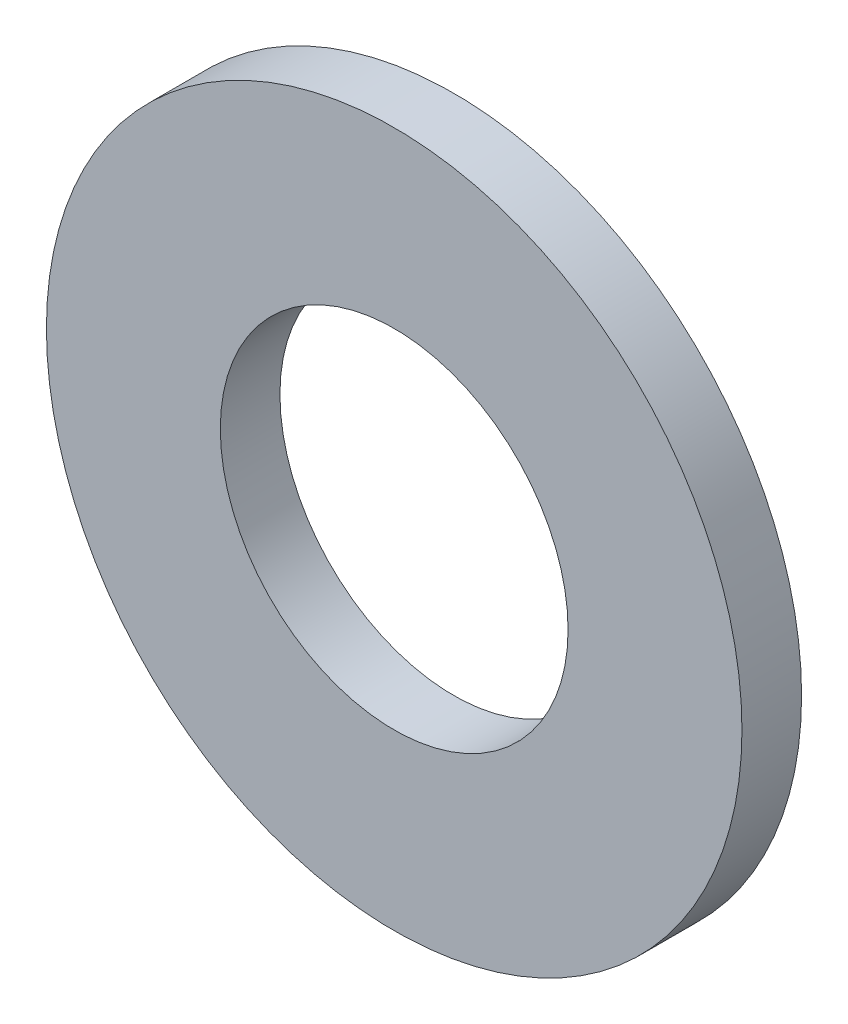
ISO-10303-21;
HEADER;
FILE_DESCRIPTION(('STEP AP214'),'2;1');
FILE_NAME('part.step','',(''),(''),'','','');
FILE_SCHEMA(('AUTOMOTIVE_DESIGN { 1 0 10303 214 1 1 1 1 }'));
ENDSEC;
DATA;
#1=APPLICATION_CONTEXT('core data for automotive mechanical design processes');
#2=APPLICATION_PROTOCOL_DEFINITION('international standard','automotive_design',2000,#1);
#3=PRODUCT_CONTEXT('',#1,'mechanical');
#4=PRODUCT('Part','Part','',(#3));
#5=PRODUCT_RELATED_PRODUCT_CATEGORY('part','',(#4));
#6=PRODUCT_DEFINITION_FORMATION('','',#4);
#7=PRODUCT_DEFINITION_CONTEXT('part definition',#1,'design');
#8=PRODUCT_DEFINITION('design','',#6,#7);
#9=PRODUCT_DEFINITION_SHAPE('','',#8);
#10=(LENGTH_UNIT() NAMED_UNIT(*) SI_UNIT(.MILLI.,.METRE.));
#11=(NAMED_UNIT(*) PLANE_ANGLE_UNIT() SI_UNIT($,.RADIAN.));
#12=(NAMED_UNIT(*) SI_UNIT($,.STERADIAN.) SOLID_ANGLE_UNIT());
#13=UNCERTAINTY_MEASURE_WITH_UNIT(LENGTH_MEASURE(1.E-05),#10,'distance_accuracy_value','');
#14=(GEOMETRIC_REPRESENTATION_CONTEXT(3) GLOBAL_UNCERTAINTY_ASSIGNED_CONTEXT((#13)) GLOBAL_UNIT_ASSIGNED_CONTEXT((#10,
#11,#12)) REPRESENTATION_CONTEXT('',''));
#15=CARTESIAN_POINT('',(0.,0.,0.));
#16=DIRECTION('',(0.,0.,1.));
#17=DIRECTION('',(1.,0.,0.));
#18=AXIS2_PLACEMENT_3D('',#15,#16,#17);
#19=CARTESIAN_POINT('',(0.,0.,0.6));
#20=DIRECTION('',(0.,0.,1.));
#21=DIRECTION('',(1.,0.,0.));
#22=AXIS2_PLACEMENT_3D('',#19,#20,#21);
#23=PLANE('',#22);
#24=CARTESIAN_POINT('',(0.,0.,0.6));
#25=DIRECTION('',(0.,0.,1.));
#26=DIRECTION('',(1.,0.,0.));
#27=AXIS2_PLACEMENT_3D('',#24,#25,#26);
#28=CIRCLE('',#27,7.);
#29=CARTESIAN_POINT('',(7.,0.,0.6));
#30=VERTEX_POINT('',#29);
#31=EDGE_CURVE('E10',#30,#30,#28,.T.);
#32=ORIENTED_EDGE('',*,*,#31,.T.);
#33=EDGE_LOOP('',(#32));
#34=FACE_BOUND('',#33,.T.);
#35=CARTESIAN_POINT('',(0.,0.,0.6));
#36=DIRECTION('',(0.,0.,1.));
#37=DIRECTION('',(1.,0.,0.));
#38=AXIS2_PLACEMENT_3D('',#35,#36,#37);
#39=CIRCLE('',#38,3.5);
#40=CARTESIAN_POINT('',(3.5,0.,0.6));
#41=VERTEX_POINT('',#40);
#42=EDGE_CURVE('E40',#41,#41,#39,.T.);
#43=ORIENTED_EDGE('',*,*,#42,.F.);
#44=EDGE_LOOP('',(#43));
#45=FACE_BOUND('',#44,.T.);
#46=ADVANCED_FACE('F29',(#34,#45),#23,.T.);
#47=CARTESIAN_POINT('',(0.,0.,-0.6));
#48=DIRECTION('',(0.,0.,1.));
#49=DIRECTION('',(1.,0.,0.));
#50=AXIS2_PLACEMENT_3D('',#47,#48,#49);
#51=PLANE('',#50);
#52=CARTESIAN_POINT('',(0.,0.,-0.6));
#53=DIRECTION('',(0.,0.,1.));
#54=DIRECTION('',(1.,0.,0.));
#55=AXIS2_PLACEMENT_3D('',#52,#53,#54);
#56=CIRCLE('',#55,7.);
#57=CARTESIAN_POINT('',(7.,0.,-0.6));
#58=VERTEX_POINT('',#57);
#59=EDGE_CURVE('E36',#58,#58,#56,.T.);
#60=ORIENTED_EDGE('',*,*,#59,.F.);
#61=EDGE_LOOP('',(#60));
#62=FACE_BOUND('',#61,.T.);
#63=CARTESIAN_POINT('',(0.,0.,-0.6));
#64=DIRECTION('',(0.,0.,1.));
#65=DIRECTION('',(1.,0.,0.));
#66=AXIS2_PLACEMENT_3D('',#63,#64,#65);
#67=CIRCLE('',#66,3.5);
#68=CARTESIAN_POINT('',(3.5,0.,-0.6));
#69=VERTEX_POINT('',#68);
#70=EDGE_CURVE('E44',#69,#69,#67,.T.);
#71=ORIENTED_EDGE('',*,*,#70,.T.);
#72=EDGE_LOOP('',(#71));
#73=FACE_BOUND('',#72,.T.);
#74=ADVANCED_FACE('F50',(#62,#73),#51,.F.);
#75=CARTESIAN_POINT('',(0.,0.,0.6));
#76=DIRECTION('',(0.,0.,-1.));
#77=DIRECTION('',(-1.,0.,0.));
#78=AXIS2_PLACEMENT_3D('',#75,#76,#77);
#79=CYLINDRICAL_SURFACE('',#78,7.);
#80=ORIENTED_EDGE('',*,*,#31,.F.);
#81=EDGE_LOOP('',(#80));
#82=FACE_BOUND('',#81,.T.);
#83=ORIENTED_EDGE('',*,*,#59,.T.);
#84=EDGE_LOOP('',(#83));
#85=FACE_BOUND('',#84,.T.);
#86=ADVANCED_FACE('F31',(#82,#85),#79,.T.);
#87=CARTESIAN_POINT('',(0.,0.,0.6));
#88=DIRECTION('',(0.,0.,-1.));
#89=DIRECTION('',(-1.,0.,0.));
#90=AXIS2_PLACEMENT_3D('',#87,#88,#89);
#91=CYLINDRICAL_SURFACE('',#90,3.5);
#92=ORIENTED_EDGE('',*,*,#42,.T.);
#93=EDGE_LOOP('',(#92));
#94=FACE_BOUND('',#93,.T.);
#95=ORIENTED_EDGE('',*,*,#70,.F.);
#96=EDGE_LOOP('',(#95));
#97=FACE_BOUND('',#96,.T.);
#98=ADVANCED_FACE('F52',(#94,#97),#91,.F.);
#99=CLOSED_SHELL('',(#46,#74,#86,#98));
#100=MANIFOLD_SOLID_BREP('B2',#99);
#101=ADVANCED_BREP_SHAPE_REPRESENTATION('',(#18,#100),#14);
#102=SHAPE_DEFINITION_REPRESENTATION(#9,#101);
ENDSEC;
END-ISO-10303-21;
